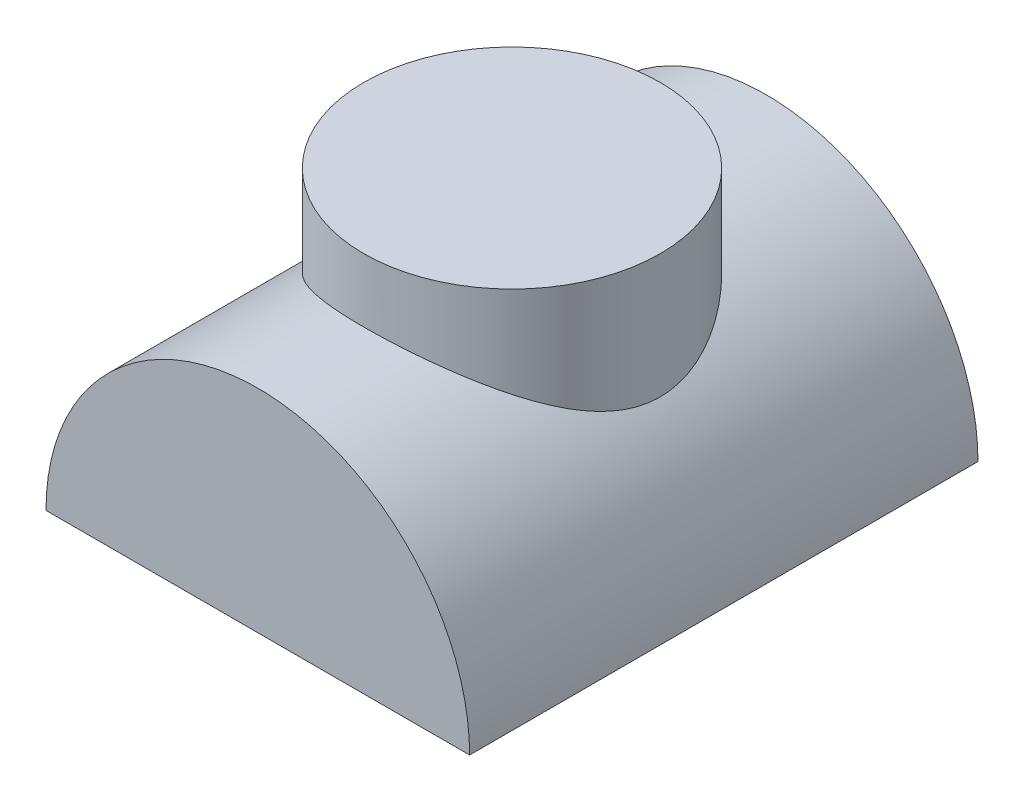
ISO-10303-21;
HEADER;
FILE_DESCRIPTION(('STEP AP214'),'2;1');
FILE_NAME('part.step','',(''),(''),'','','');
FILE_SCHEMA(('AUTOMOTIVE_DESIGN { 1 0 10303 214 1 1 1 1 }'));
ENDSEC;
DATA;
#1=APPLICATION_CONTEXT('core data for automotive mechanical design processes');
#2=APPLICATION_PROTOCOL_DEFINITION('international standard','automotive_design',2000,#1);
#3=PRODUCT_CONTEXT('',#1,'mechanical');
#4=PRODUCT('Part','Part','',(#3));
#5=PRODUCT_RELATED_PRODUCT_CATEGORY('part','',(#4));
#6=PRODUCT_DEFINITION_FORMATION('','',#4);
#7=PRODUCT_DEFINITION_CONTEXT('part definition',#1,'design');
#8=PRODUCT_DEFINITION('design','',#6,#7);
#9=PRODUCT_DEFINITION_SHAPE('','',#8);
#10=(LENGTH_UNIT() NAMED_UNIT(*) SI_UNIT(.MILLI.,.METRE.));
#11=(NAMED_UNIT(*) PLANE_ANGLE_UNIT() SI_UNIT($,.RADIAN.));
#12=(NAMED_UNIT(*) SI_UNIT($,.STERADIAN.) SOLID_ANGLE_UNIT());
#13=UNCERTAINTY_MEASURE_WITH_UNIT(LENGTH_MEASURE(1.E-05),#10,'distance_accuracy_value','');
#14=(GEOMETRIC_REPRESENTATION_CONTEXT(3) GLOBAL_UNCERTAINTY_ASSIGNED_CONTEXT((#13)) GLOBAL_UNIT_ASSIGNED_CONTEXT((#10,
#11,#12)) REPRESENTATION_CONTEXT('',''));
#15=CARTESIAN_POINT('',(0.,0.,0.));
#16=DIRECTION('',(0.,0.,1.));
#17=DIRECTION('',(1.,0.,0.));
#18=AXIS2_PLACEMENT_3D('',#15,#16,#17);
#19=CARTESIAN_POINT('',(0.,0.,60.));
#20=DIRECTION('',(0.,0.,-1.));
#21=DIRECTION('',(-1.,0.,0.));
#22=AXIS2_PLACEMENT_3D('',#19,#20,#21);
#23=CYLINDRICAL_SURFACE('',#22,50.);
#24=CARTESIAN_POINT('',(0.,0.,-60.));
#25=DIRECTION('',(0.,0.,1.));
#26=DIRECTION('',(-1.,0.,0.));
#27=AXIS2_PLACEMENT_3D('',#24,#25,#26);
#28=CIRCLE('',#27,50.);
#29=CARTESIAN_POINT('',(50.,0.,-60.));
#30=VERTEX_POINT('',#29);
#31=CARTESIAN_POINT('',(-50.,0.,-60.));
#32=VERTEX_POINT('',#31);
#33=EDGE_CURVE('E67',#30,#32,#28,.T.);
#34=ORIENTED_EDGE('',*,*,#33,.T.);
#35=DIRECTION('',(0.,0.,-1.));
#36=VECTOR('',#35,1.);
#37=CARTESIAN_POINT('',(-50.,0.,60.));
#38=LINE('',#37,#36);
#39=CARTESIAN_POINT('',(-50.,0.,60.));
#40=VERTEX_POINT('',#39);
#41=EDGE_CURVE('E42',#40,#32,#38,.T.);
#42=ORIENTED_EDGE('',*,*,#41,.F.);
#43=CARTESIAN_POINT('',(0.,0.,60.));
#44=DIRECTION('',(0.,0.,1.));
#45=DIRECTION('',(-1.,0.,0.));
#46=AXIS2_PLACEMENT_3D('',#43,#44,#45);
#47=CIRCLE('',#46,50.);
#48=CARTESIAN_POINT('',(50.,0.,60.));
#49=VERTEX_POINT('',#48);
#50=EDGE_CURVE('E66',#49,#40,#47,.T.);
#51=ORIENTED_EDGE('',*,*,#50,.F.);
#52=DIRECTION('',(0.,0.,-1.));
#53=VECTOR('',#52,1.);
#54=CARTESIAN_POINT('',(50.,0.,60.));
#55=LINE('',#54,#53);
#56=EDGE_CURVE('E62',#49,#30,#55,.T.);
#57=ORIENTED_EDGE('',*,*,#56,.T.);
#58=EDGE_LOOP('',(#34,#42,#51,#57));
#59=FACE_BOUND('',#58,.T.);
#60=CARTESIAN_POINT('',(0.,50.,-35.));
#61=CARTESIAN_POINT('',(-0.870232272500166,50.0000046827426,-35.0000050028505));
#62=CARTESIAN_POINT('',(-1.7404063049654,49.977236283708,-34.9675030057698));
#63=CARTESIAN_POINT('',(-3.47352174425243,49.8867459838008,-34.83804802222));
#64=CARTESIAN_POINT('',(-4.33646377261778,49.8190279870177,-34.741100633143));
#65=CARTESIAN_POINT('',(-6.04853863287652,49.64026883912,-34.4842684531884));
#66=CARTESIAN_POINT('',(-6.89766808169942,49.5292172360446,-34.3243684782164));
#67=CARTESIAN_POINT('',(-8.57578993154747,49.2663904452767,-33.9440143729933));
#68=CARTESIAN_POINT('',(-9.4047816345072,49.1146138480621,-33.7235581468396));
#69=CARTESIAN_POINT('',(-11.0332645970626,48.7745391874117,-33.2263207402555));
#70=CARTESIAN_POINT('',(-11.8328814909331,48.5864254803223,-32.949823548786));
#71=CARTESIAN_POINT('',(-13.4026192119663,48.1770464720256,-32.3431278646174));
#72=CARTESIAN_POINT('',(-14.1727403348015,47.9557815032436,-32.0129299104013));
#73=CARTESIAN_POINT('',(-15.6801115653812,47.484289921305,-31.3022123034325));
#74=CARTESIAN_POINT('',(-16.4173617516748,47.2340633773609,-30.9216927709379));
#75=CARTESIAN_POINT('',(-17.8564301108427,46.7090427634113,-30.1136018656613));
#76=CARTESIAN_POINT('',(-18.5582465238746,46.434247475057,-29.6860281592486));
#77=CARTESIAN_POINT('',(-19.9848211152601,45.8394551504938,-28.7471572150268));
#78=CARTESIAN_POINT('',(-20.7061360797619,45.5176092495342,-28.2318011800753));
#79=CARTESIAN_POINT('',(-22.102634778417,44.8561100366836,-27.1523945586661));
#80=CARTESIAN_POINT('',(-22.7778163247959,44.5164558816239,-26.5883416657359));
#81=CARTESIAN_POINT('',(-24.0815274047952,43.824938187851,-25.4135997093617));
#82=CARTESIAN_POINT('',(-24.7099908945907,43.4730583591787,-24.8028470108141));
#83=CARTESIAN_POINT('',(-25.917999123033,42.7638631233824,-23.5376807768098));
#84=CARTESIAN_POINT('',(-26.4975410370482,42.4065474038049,-22.883264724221));
#85=CARTESIAN_POINT('',(-27.7041565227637,41.6302860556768,-21.4134589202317));
#86=CARTESIAN_POINT('',(-28.3216161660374,41.2115730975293,-20.5900212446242));
#87=CARTESIAN_POINT('',(-29.4846248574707,40.3876824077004,-18.8870417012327));
#88=CARTESIAN_POINT('',(-30.030155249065,39.9825082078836,-18.0074853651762));
#89=CARTESIAN_POINT('',(-31.0449435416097,39.1997644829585,-16.1953260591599));
#90=CARTESIAN_POINT('',(-31.5142997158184,38.8221597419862,-15.2627935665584));
#91=CARTESIAN_POINT('',(-32.3725792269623,38.1094117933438,-13.3460634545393));
#92=CARTESIAN_POINT('',(-32.7615449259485,37.774246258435,-12.3618933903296));
#93=CARTESIAN_POINT('',(-33.3451470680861,37.2585850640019,-10.6601711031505));
#94=CARTESIAN_POINT('',(-33.5625682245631,37.0624390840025,-9.95511151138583));
#95=CARTESIAN_POINT('',(-33.9540987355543,36.7040823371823,-8.52459851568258));
#96=CARTESIAN_POINT('',(-34.1282150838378,36.5418660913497,-7.79914842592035));
#97=CARTESIAN_POINT('',(-34.4305317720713,36.2571602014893,-6.33231404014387));
#98=CARTESIAN_POINT('',(-34.5588090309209,36.1346040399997,-5.59095867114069));
#99=CARTESIAN_POINT('',(-34.7677456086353,35.9336193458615,-4.09556918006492));
#100=CARTESIAN_POINT('',(-34.8484050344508,35.8551907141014,-3.34153508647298));
#101=CARTESIAN_POINT('',(-34.9608969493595,35.7455170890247,-1.82193032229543));
#102=CARTESIAN_POINT('',(-34.9924426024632,35.7145492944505,-1.05631805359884));
#103=CARTESIAN_POINT('',(-35.0051496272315,35.7020949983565,0.475730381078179));
#104=CARTESIAN_POINT('',(-34.9863111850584,35.7206083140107,1.24216654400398));
#105=CARTESIAN_POINT('',(-34.8986208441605,35.8062836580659,2.76984985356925));
#106=CARTESIAN_POINT('',(-34.8297390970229,35.8734747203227,3.53109362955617));
#107=CARTESIAN_POINT('',(-34.6432842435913,36.0535648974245,5.04206377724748));
#108=CARTESIAN_POINT('',(-34.5257101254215,36.1664649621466,5.79178990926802));
#109=CARTESIAN_POINT('',(-34.2532963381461,36.4245018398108,7.2255354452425));
#110=CARTESIAN_POINT('',(-34.1014533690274,36.5669968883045,7.91060977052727));
#111=CARTESIAN_POINT('',(-33.7589888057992,36.8833971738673,9.26380107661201));
#112=CARTESIAN_POINT('',(-33.5683529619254,37.0573139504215,9.9319117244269));
#113=CARTESIAN_POINT('',(-33.1501750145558,37.4318666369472,11.2491653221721));
#114=CARTESIAN_POINT('',(-32.9226130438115,37.6325169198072,11.8982978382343));
#115=CARTESIAN_POINT('',(-32.4325419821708,38.0556836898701,13.1756669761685));
#116=CARTESIAN_POINT('',(-32.1700382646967,38.2781968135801,13.8039067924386));
#117=CARTESIAN_POINT('',(-31.4634650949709,38.8633221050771,15.3663950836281));
#118=CARTESIAN_POINT('',(-30.996945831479,39.2376405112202,16.2861965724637));
#119=CARTESIAN_POINT('',(-29.990231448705,40.0123702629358,18.0731428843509));
#120=CARTESIAN_POINT('',(-29.4500062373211,40.4127922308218,18.9402659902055));
#121=CARTESIAN_POINT('',(-28.2982946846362,41.2274781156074,20.6215052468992));
#122=CARTESIAN_POINT('',(-27.6866822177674,41.6417655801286,21.4355234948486));
#123=CARTESIAN_POINT('',(-26.395557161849,42.4719157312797,23.0067017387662));
#124=CARTESIAN_POINT('',(-25.716053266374,42.8877782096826,23.7638689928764));
#125=CARTESIAN_POINT('',(-24.282503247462,43.7155961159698,25.227400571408));
#126=CARTESIAN_POINT('',(-23.5276600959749,44.1274446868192,25.9330457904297));
#127=CARTESIAN_POINT('',(-21.9523703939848,44.9318997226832,27.2794229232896));
#128=CARTESIAN_POINT('',(-21.1319177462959,45.3245043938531,27.9201487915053));
#129=CARTESIAN_POINT('',(-19.4296026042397,46.0798886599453,29.1303820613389));
#130=CARTESIAN_POINT('',(-18.5478533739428,46.4427206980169,29.7000156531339));
#131=CARTESIAN_POINT('',(-16.7254223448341,47.1296898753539,30.7631633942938));
#132=CARTESIAN_POINT('',(-15.7847582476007,47.4538385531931,31.2567002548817));
#133=CARTESIAN_POINT('',(-14.0638566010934,47.9878194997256,32.0608786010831));
#134=CARTESIAN_POINT('',(-13.294127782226,48.2070816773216,32.3878323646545));
#135=CARTESIAN_POINT('',(-11.7255644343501,48.6124153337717,32.98811888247));
#136=CARTESIAN_POINT('',(-10.9267338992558,48.7984913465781,33.2614589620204));
#137=CARTESIAN_POINT('',(-9.30461607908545,49.1335896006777,33.7511702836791));
#138=CARTESIAN_POINT('',(-8.48134125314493,49.2826303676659,33.9675700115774));
#139=CARTESIAN_POINT('',(-6.81512211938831,49.5405359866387,34.3406887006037));
#140=CARTESIAN_POINT('',(-5.97217741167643,49.6494000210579,34.4974064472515));
#141=CARTESIAN_POINT('',(-4.26917518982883,49.8247911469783,34.7493603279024));
#142=CARTESIAN_POINT('',(-3.40906158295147,49.8911424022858,34.8443411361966));
#143=CARTESIAN_POINT('',(-1.68186449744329,49.9791858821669,34.9702882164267));
#144=CARTESIAN_POINT('',(-0.814781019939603,50.0008781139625,35.0012544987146));
#145=CARTESIAN_POINT('',(0.919213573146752,49.999067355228,34.9986676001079));
#146=CARTESIAN_POINT('',(1.78612469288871,49.9755656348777,34.9651162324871));
#147=CARTESIAN_POINT('',(3.51268174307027,49.8839489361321,34.8340431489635));
#148=CARTESIAN_POINT('',(4.37232793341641,49.8158355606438,34.736523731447));
#149=CARTESIAN_POINT('',(6.0218146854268,49.6425220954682,34.4874963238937));
#150=CARTESIAN_POINT('',(6.81254374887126,49.5400387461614,34.3399362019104));
#151=CARTESIAN_POINT('',(8.37678839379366,49.2996505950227,33.9922245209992));
#152=CARTESIAN_POINT('',(9.15030488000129,49.1617476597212,33.7920757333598));
#153=CARTESIAN_POINT('',(10.6758813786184,48.8531610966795,33.3415398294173));
#154=CARTESIAN_POINT('',(11.4279395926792,48.6824747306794,33.0911485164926));
#155=CARTESIAN_POINT('',(12.9069400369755,48.3114097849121,32.5427880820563));
#156=CARTESIAN_POINT('',(13.6338808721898,48.1110295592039,32.244816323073));
#157=CARTESIAN_POINT('',(15.1100577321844,47.668867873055,31.5814246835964));
#158=CARTESIAN_POINT('',(15.8572430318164,47.4251620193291,31.2127277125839));
#159=CARTESIAN_POINT('',(17.3166332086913,46.9119671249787,30.4273074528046));
#160=CARTESIAN_POINT('',(18.0288368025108,46.6424771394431,30.0105824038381));
#161=CARTESIAN_POINT('',(19.4164933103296,46.0821002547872,29.1320185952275));
#162=CARTESIAN_POINT('',(20.0919284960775,45.7912031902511,28.6701583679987));
#163=CARTESIAN_POINT('',(21.4041263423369,45.1927373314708,27.7042811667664));
#164=CARTESIAN_POINT('',(22.0408868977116,44.8851676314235,27.2002619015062));
#165=CARTESIAN_POINT('',(23.3800396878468,44.2044129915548,26.0628453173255));
#166=CARTESIAN_POINT('',(24.0750385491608,43.8290006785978,25.4220614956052));
#167=CARTESIAN_POINT('',(25.4087931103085,43.0695056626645,24.0890524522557));
#168=CARTESIAN_POINT('',(26.0475407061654,42.6854217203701,23.3968198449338));
#169=CARTESIAN_POINT('',(27.267628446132,41.916544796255,21.9627738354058));
#170=CARTESIAN_POINT('',(27.8489237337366,41.531751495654,21.2209224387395));
#171=CARTESIAN_POINT('',(28.9516393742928,40.7707152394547,19.6899077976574));
#172=CARTESIAN_POINT('',(29.4730665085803,40.3944713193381,18.9007499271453));
#173=CARTESIAN_POINT('',(30.4067125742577,39.695574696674,17.3541850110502));
#174=CARTESIAN_POINT('',(30.8246071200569,39.3712388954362,16.6009653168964));
#175=CARTESIAN_POINT('',(31.6071001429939,38.7458650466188,15.0578711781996));
#176=CARTESIAN_POINT('',(31.971697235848,38.444827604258,14.2679957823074));
#177=CARTESIAN_POINT('',(32.6439561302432,37.8756633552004,12.6544361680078));
#178=CARTESIAN_POINT('',(32.9517078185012,37.6074848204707,11.8308078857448));
#179=CARTESIAN_POINT('',(33.5072229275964,37.1133993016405,10.1512421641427));
#180=CARTESIAN_POINT('',(33.7550024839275,36.8874809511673,9.29531348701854));
#181=CARTESIAN_POINT('',(34.1428567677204,36.5283500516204,7.7315330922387));
#182=CARTESIAN_POINT('',(34.2945793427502,36.3856289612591,7.02874420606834));
#183=CARTESIAN_POINT('',(34.5552281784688,36.1381878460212,5.60866076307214));
#184=CARTESIAN_POINT('',(34.6641599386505,36.0334629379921,4.89136808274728));
#185=CARTESIAN_POINT('',(34.8373963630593,35.8660062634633,3.44731721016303));
#186=CARTESIAN_POINT('',(34.9017502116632,35.8032282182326,2.72057035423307));
#187=CARTESIAN_POINT('',(34.9848682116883,35.7220160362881,1.26196217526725));
#188=CARTESIAN_POINT('',(35.0036319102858,35.7035823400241,0.5301008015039));
#189=CARTESIAN_POINT('',(34.9952029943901,35.7118439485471,-0.933973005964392));
#190=CARTESIAN_POINT('',(34.9679555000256,35.7385931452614,-1.66618481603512));
#191=CARTESIAN_POINT('',(34.8679201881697,35.8361961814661,-3.12447973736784));
#192=CARTESIAN_POINT('',(34.7951326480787,35.9070497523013,-3.85056288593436));
#193=CARTESIAN_POINT('',(34.6051877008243,36.0901414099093,-5.29249658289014));
#194=CARTESIAN_POINT('',(34.4879747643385,36.2024312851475,-6.00833315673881));
#195=CARTESIAN_POINT('',(34.2110182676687,36.4642622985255,-7.42477357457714));
#196=CARTESIAN_POINT('',(34.0512690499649,36.6138083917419,-8.12537537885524));
#197=CARTESIAN_POINT('',(33.6404354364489,36.9921554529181,-9.7036406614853));
#198=CARTESIAN_POINT('',(33.376297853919,37.2314112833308,-10.5754147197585));
#199=CARTESIAN_POINT('',(32.7858092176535,37.7524242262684,-12.2844975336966));
#200=CARTESIAN_POINT('',(32.4594391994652,38.034194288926,-13.1217956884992));
#201=CARTESIAN_POINT('',(31.7479704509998,38.6300643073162,-14.7602513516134));
#202=CARTESIAN_POINT('',(31.3628028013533,38.9442020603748,-15.5613649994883));
#203=CARTESIAN_POINT('',(30.5371993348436,39.5948947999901,-17.1248665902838));
#204=CARTESIAN_POINT('',(30.0967667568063,39.9314484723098,-17.8872567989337));
#205=CARTESIAN_POINT('',(29.1519412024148,40.6265479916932,-19.3899619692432));
#206=CARTESIAN_POINT('',(28.6462778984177,40.985426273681,-20.1293230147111));
#207=CARTESIAN_POINT('',(27.5815143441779,41.7094065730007,-21.5652255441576));
#208=CARTESIAN_POINT('',(27.0224143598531,42.074508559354,-22.2617672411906));
#209=CARTESIAN_POINT('',(25.8521175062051,42.8035444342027,-23.6107068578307));
#210=CARTESIAN_POINT('',(25.2409057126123,43.167477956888,-24.2630920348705));
#211=CARTESIAN_POINT('',(23.9678165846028,43.8871120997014,-25.5214602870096));
#212=CARTESIAN_POINT('',(23.3059338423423,44.24281183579,-26.1274383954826));
#213=CARTESIAN_POINT('',(21.8062903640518,45.003517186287,-27.397459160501));
#214=CARTESIAN_POINT('',(20.9585928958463,45.4055331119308,-28.0516304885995));
#215=CARTESIAN_POINT('',(19.1968024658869,46.1780037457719,-29.2854798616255));
#216=CARTESIAN_POINT('',(18.2826994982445,46.5484536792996,-29.8651466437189));
#217=CARTESIAN_POINT('',(16.3931041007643,47.2470080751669,-30.9426542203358));
#218=CARTESIAN_POINT('',(15.4176640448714,47.5751479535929,-31.4405635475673));
#219=CARTESIAN_POINT('',(13.4109161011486,48.1792930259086,-32.3474679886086));
#220=CARTESIAN_POINT('',(12.3796240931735,48.4553129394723,-32.7564882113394));
#221=CARTESIAN_POINT('',(10.4286834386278,48.9089902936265,-33.4236386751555));
#222=CARTESIAN_POINT('',(9.51560891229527,49.0952007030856,-33.6952158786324));
#223=CARTESIAN_POINT('',(7.66208842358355,49.4183857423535,-34.1643944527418));
#224=CARTESIAN_POINT('',(6.72164532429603,49.5553655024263,-34.3620035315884));
#225=CARTESIAN_POINT('',(4.82256952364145,49.7760550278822,-34.679513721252));
#226=CARTESIAN_POINT('',(3.86395723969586,49.8598213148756,-34.7994972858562));
#227=CARTESIAN_POINT('',(1.93687202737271,49.971788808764,-34.9597342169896));
#228=CARTESIAN_POINT('',(0.968399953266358,49.9999947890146,-34.9999944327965));
#229=CARTESIAN_POINT('',(0.,50.,-35.));
#230=B_SPLINE_CURVE_WITH_KNOTS('',3,(#60,#61,#62,#63,#64,#65,#66,#67,#68,#69,#70,#71,#72,#73,
#74,#75,#76,#77,#78,#79,#80,#81,#82,#83,#84,#85,#86,#87,#88,#89,#90,#91,#92,#93,#94,#95,#96,#97,
#98,#99,#100,#101,#102,#103,#104,#105,#106,#107,#108,#109,#110,#111,#112,#113,#114,#115,#116,
#117,#118,#119,#120,#121,#122,#123,#124,#125,#126,#127,#128,#129,#130,#131,#132,#133,#134,#135,
#136,#137,#138,#139,#140,#141,#142,#143,#144,#145,#146,#147,#148,#149,#150,#151,#152,#153,#154,
#155,#156,#157,#158,#159,#160,#161,#162,#163,#164,#165,#166,#167,#168,#169,#170,#171,#172,#173,
#174,#175,#176,#177,#178,#179,#180,#181,#182,#183,#184,#185,#186,#187,#188,#189,#190,#191,#192,
#193,#194,#195,#196,#197,#198,#199,#200,#201,#202,#203,#204,#205,#206,#207,#208,#209,#210,#211,
#212,#213,#214,#215,#216,#217,#218,#219,#220,#221,#222,#223,#224,#225,#226,#227,#228,#229),
.UNSPECIFIED.,.T.,.F.,(4,2,2,2,2,2,2,2,2,2,2,2,2,2,2,2,2,2,2,2,2,2,2,2,2,2,2,2,2,2,2,2,2,2,2,2,
2,2,2,2,2,2,2,2,2,2,2,2,2,2,2,2,2,2,2,2,2,2,2,2,2,2,2,2,2,2,2,2,2,2,2,2,2,2,2,2,2,2,2,2,2,2,2,2,
4),(0.,2.60970041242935,5.2191741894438,7.82927775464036,10.4394716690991,13.0367549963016,
15.6340122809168,18.2312633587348,20.8286433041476,23.6552943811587,26.4820794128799,
29.3127874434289,32.1436588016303,35.4732627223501,38.803728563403,42.1298629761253,
45.4542401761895,47.7426149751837,50.030619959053,52.3147673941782,54.5989096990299,
56.8963425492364,59.1937669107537,61.4925627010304,63.7914062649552,65.9374376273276,
68.0842587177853,70.2322387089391,72.3798887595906,75.6667414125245,78.9549400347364,
82.249038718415,85.5427161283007,88.8759385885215,92.2094711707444,95.5369998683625,
98.8635335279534,101.454642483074,104.045397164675,106.634853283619,109.224362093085,
111.82451332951,114.424664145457,117.024741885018,119.624726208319,122.054675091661,
124.484495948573,126.914519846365,129.344678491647,131.946449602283,134.548316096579,
137.151426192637,139.754677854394,142.803032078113,145.851824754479,148.902979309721,
151.953787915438,154.712674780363,157.471633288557,160.226191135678,162.980007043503,
165.176869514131,167.373449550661,169.567602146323,171.76177653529,173.958569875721,
176.155349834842,178.354884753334,180.554712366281,183.375960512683,186.198069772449,
189.023512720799,191.848790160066,194.741148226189,197.63349189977,200.526666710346,
203.420150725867,206.846723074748,210.273812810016,213.698014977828,217.121248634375,
220.028985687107,222.936419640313,225.840760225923,228.744851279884),.UNSPECIFIED.);
#231=CARTESIAN_POINT('',(0.,50.,-35.));
#232=VERTEX_POINT('',#231);
#233=EDGE_CURVE('E11',#232,#232,#230,.T.);
#234=ORIENTED_EDGE('',*,*,#233,.F.);
#235=EDGE_LOOP('',(#234));
#236=FACE_BOUND('',#235,.T.);
#237=ADVANCED_FACE('F30',(#59,#236),#23,.T.);
#238=CARTESIAN_POINT('',(50.,0.,60.));
#239=DIRECTION('',(0.,1.,0.));
#240=DIRECTION('',(0.,0.,1.));
#241=AXIS2_PLACEMENT_3D('',#238,#239,#240);
#242=PLANE('',#241);
#243=DIRECTION('',(1.,0.,0.));
#244=VECTOR('',#243,1.);
#245=CARTESIAN_POINT('',(50.,0.,-60.));
#246=LINE('',#245,#244);
#247=EDGE_CURVE('E57',#32,#30,#246,.T.);
#248=ORIENTED_EDGE('',*,*,#247,.T.);
#249=ORIENTED_EDGE('',*,*,#56,.F.);
#250=DIRECTION('',(1.,0.,0.));
#251=VECTOR('',#250,1.);
#252=CARTESIAN_POINT('',(50.,0.,60.));
#253=LINE('',#252,#251);
#254=EDGE_CURVE('E49',#40,#49,#253,.T.);
#255=ORIENTED_EDGE('',*,*,#254,.F.);
#256=ORIENTED_EDGE('',*,*,#41,.T.);
#257=EDGE_LOOP('',(#248,#249,#255,#256));
#258=FACE_BOUND('',#257,.T.);
#259=ADVANCED_FACE('F61',(#258),#242,.F.);
#260=CARTESIAN_POINT('',(0.,0.,60.));
#261=DIRECTION('',(0.,0.,-1.));
#262=DIRECTION('',(-1.,0.,0.));
#263=AXIS2_PLACEMENT_3D('',#260,#261,#262);
#264=PLANE('',#263);
#265=ORIENTED_EDGE('',*,*,#50,.T.);
#266=ORIENTED_EDGE('',*,*,#254,.T.);
#267=EDGE_LOOP('',(#265,#266));
#268=FACE_BOUND('',#267,.T.);
#269=ADVANCED_FACE('F79',(#268),#264,.F.);
#270=CARTESIAN_POINT('',(0.,0.,-60.));
#271=DIRECTION('',(0.,0.,-1.));
#272=DIRECTION('',(-1.,0.,0.));
#273=AXIS2_PLACEMENT_3D('',#270,#271,#272);
#274=PLANE('',#273);
#275=ORIENTED_EDGE('',*,*,#33,.F.);
#276=ORIENTED_EDGE('',*,*,#247,.F.);
#277=EDGE_LOOP('',(#275,#276));
#278=FACE_BOUND('',#277,.T.);
#279=ADVANCED_FACE('F72',(#278),#274,.T.);
#280=CARTESIAN_POINT('',(0.,0.,0.));
#281=DIRECTION('',(0.,-1.,0.));
#282=DIRECTION('',(0.,0.,-1.));
#283=AXIS2_PLACEMENT_3D('',#280,#281,#282);
#284=CYLINDRICAL_SURFACE('',#283,35.);
#285=CARTESIAN_POINT('',(0.,65.,0.));
#286=DIRECTION('',(0.,-1.,0.));
#287=DIRECTION('',(0.,0.,-1.));
#288=AXIS2_PLACEMENT_3D('',#285,#286,#287);
#289=CIRCLE('',#288,35.);
#290=CARTESIAN_POINT('',(0.,65.,-35.));
#291=VERTEX_POINT('',#290);
#292=EDGE_CURVE('E73',#291,#291,#289,.T.);
#293=ORIENTED_EDGE('',*,*,#292,.T.);
#294=EDGE_LOOP('',(#293));
#295=FACE_BOUND('',#294,.T.);
#296=ORIENTED_EDGE('',*,*,#233,.T.);
#297=EDGE_LOOP('',(#296));
#298=FACE_BOUND('',#297,.T.);
#299=ADVANCED_FACE('F86',(#295,#298),#284,.T.);
#300=CARTESIAN_POINT('',(-17.4201787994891,65.,0.));
#301=DIRECTION('',(0.,-1.,0.));
#302=DIRECTION('',(0.,0.,-1.));
#303=AXIS2_PLACEMENT_3D('',#300,#301,#302);
#304=PLANE('',#303);
#305=ORIENTED_EDGE('',*,*,#292,.F.);
#306=EDGE_LOOP('',(#305));
#307=FACE_BOUND('',#306,.T.);
#308=ADVANCED_FACE('F113',(#307),#304,.F.);
#309=CLOSED_SHELL('',(#237,#259,#269,#279,#299,#308));
#310=MANIFOLD_SOLID_BREP('B2',#309);
#311=ADVANCED_BREP_SHAPE_REPRESENTATION('',(#18,#310),#14);
#312=SHAPE_DEFINITION_REPRESENTATION(#9,#311);
ENDSEC;
END-ISO-10303-21;
